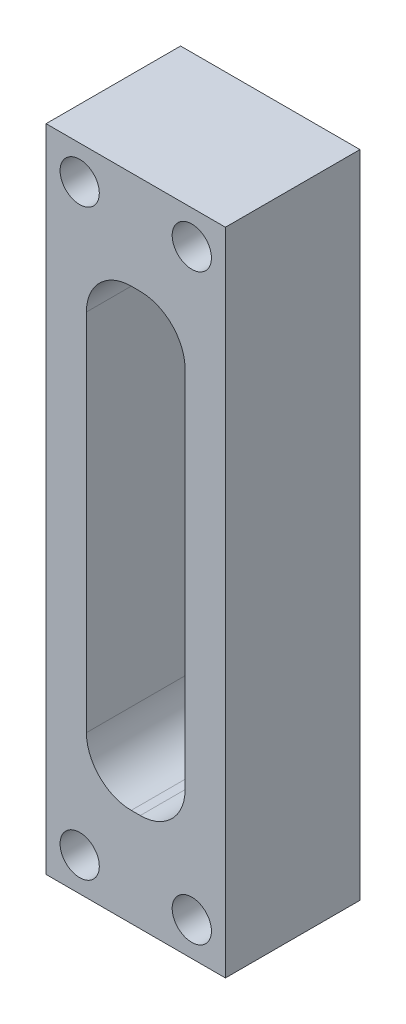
from build123d import *

# Parameters (mm, degrees)
SKETCH1_W                       = 25.4
SKETCH1_H                       = 92.075
EXTRUDE1_DEPTH                  = 9.525
F_7_32_0_21875_DIAMETER_HOLE1_D = 5.55625


with BuildPart() as part:
    # Sketch1 → Extrude1 (new, symmetric)
    with BuildSketch(Plane.XY):
        Rectangle(SKETCH1_W, SKETCH1_H)
        with BuildLine():
            Line((-0.635, 32.1437), (0.635, 32.1437))
            ThreePointArc((0.635, 32.1437), (5.125128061, 30.283828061), (6.985, 25.7937))
            Line((6.985, 25.7937), (6.985, -25.7937))
            ThreePointArc((6.985, -25.7937), (5.125128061, -30.283828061), (0.635, -32.1437))
            Line((0.635, -32.1437), (-0.635, -32.1437))
            ThreePointArc((-0.635, -32.1437), (-5.125128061, -30.283828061), (-6.985, -25.7937))
            Line((-6.985, -25.7937), (-6.985, 25.7937))
            ThreePointArc((-6.985, 25.7937), (-5.125128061, 30.283828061), (-0.635, 32.1437))
        make_face(mode=Mode.SUBTRACT)
    extrude(amount=EXTRUDE1_DEPTH, both=True)

    # 7_32 _0.21875_ Diameter Hole1 (through all)
    with Locations(Plane.XY.offset(9.525)):
        with Locations((-7.9375, 41.275), (7.9375, 41.275), (7.9375, -41.275), (-7.9375, -41.275)):
            Hole(F_7_32_0_21875_DIAMETER_HOLE1_D / 2)


solid = part.part
